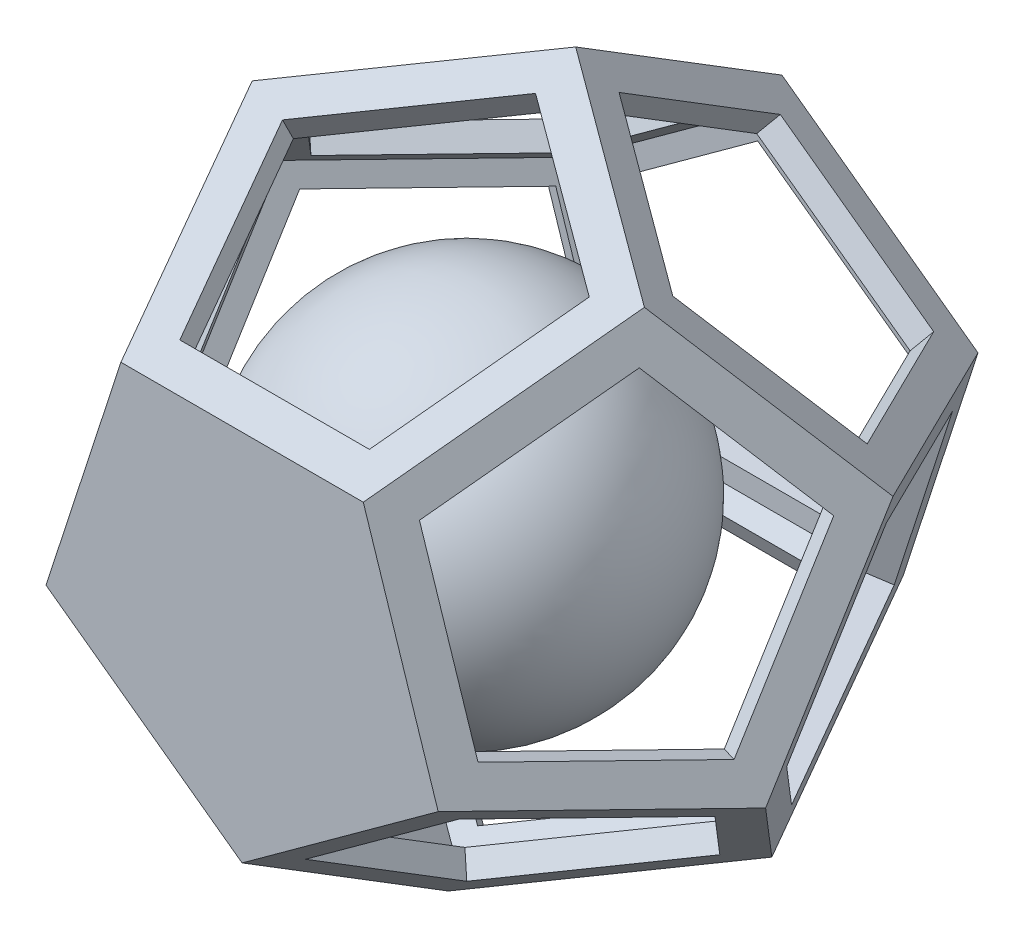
from build123d import *

# Parameters (mm, degrees)
BOSS_EXTRUDE2_DEPTH     = 44.54
BOSS_EXTRUDE2_TAPER     = -26.57
CUT_EXTRUDE_THIN1_DEPTH = 50
CUT_EXTRUDE_THIN1_TAPER = 26.57
SHELL1_T                = 2
CUT_EXTRUDE1_DEPTH      = 12
CIRPATTERN1_COUNT       = 5
CUT_EXTRUDE2_DEPTH      = 12
CIRPATTERN2_COUNT       = 5
CUT_EXTRUDE3_DEPTH      = 8


with BuildPart() as part:
    # Sketch1 → Boss-Extrude2 (new body)
    with BuildSketch(Plane.XY):
        Polygon((0, 17.013016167), (-16.180339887, 5.257311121), (-10, -13.763819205), (10, -13.763819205), (16.180339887, 5.257311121), align=None)
    extrude(amount=BOSS_EXTRUDE2_DEPTH, taper=BOSS_EXTRUDE2_TAPER)

    # Sketch3 → Cut-Extrude-Thin1 (cut)
    with BuildSketch(Plane.XY.offset(44.54)):
        Polygon((-35.42898848, 48.763819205), (-57.325307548, -18.626121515), (0, -60.27539538), (57.325307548, -18.626121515), (35.42898848, 48.763819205), align=None)
        Polygon((-10, 13.763819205), (-16.180339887, -5.257311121), (0, -17.013016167), (16.180339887, -5.257311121), (10, 13.763819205), align=None, mode=Mode.SUBTRACT)
    extrude(amount=-CUT_EXTRUDE_THIN1_DEPTH, taper=CUT_EXTRUDE_THIN1_TAPER, mode=Mode.SUBTRACT)

    # Shell1 (no face opened: a closed hollow body)
    add(offset(amount=-SHELL1_T, mode=Mode.PRIVATE), mode=Mode.SUBTRACT)

    # Sketch5 → Cut-Extrude1 (cut)
    with BuildSketch(Plane(origin=(0, 28.828412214, 14.417318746), x_dir=(1, 0, 0), z_dir=(-1.0084859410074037e-15, 0.894388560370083, 0.44729084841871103))):
        Polygon((12.654932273, -15.80331868), (0, -6.610560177), (-12.654932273, -15.80331868), (-7.820488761, -30.679636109), (7.820488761, -30.679636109), align=None)
    cut_extrude1 = extrude(amount=-CUT_EXTRUDE1_DEPTH, mode=Mode.SUBTRACT)

    # CirPattern1: Cut-Extrude1 ×5 about axis
    cirpattern1_axis = Axis((0, 0, 0), (0, 0, 1))
    for i in range(1, CIRPATTERN1_COUNT):
        add(cut_extrude1.rotate(cirpattern1_axis, i * 360 / CIRPATTERN1_COUNT), mode=Mode.SUBTRACT)

    # Sketch6 → Cut-Extrude2 (cut)
    with BuildSketch(Plane(origin=(-6.471576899, 8.907361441, -5.506240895), x_dir=(0.8506648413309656, 0.44716758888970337, -0.2764244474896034), z_dir=(-0.5257084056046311, 0.7235755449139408, -0.4472908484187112))):
        Polygon((-10.268850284, -31.598812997), (4.607669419, -26.767324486), (4.607669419, -11.125180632), (-10.267538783, -6.291097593), (-19.463045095, -18.944924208), align=None)
    cut_extrude2 = extrude(amount=-CUT_EXTRUDE2_DEPTH, mode=Mode.SUBTRACT)

    # CirPattern2: Cut-Extrude2 ×5 about axis
    cirpattern2_axis = Axis((0, 0, 0), (0, 0, 1))
    for i in range(1, CIRPATTERN2_COUNT):
        add(cut_extrude2.rotate(cirpattern2_axis, i * 360 / CIRPATTERN2_COUNT), mode=Mode.SUBTRACT)

    # Sketch9 → Cut-Extrude3 (cut)
    with BuildSketch(Plane(origin=(0, 0, 0), x_dir=(-1, 0, 0), z_dir=(0, 0, -1))):
        Polygon((0, 13.304812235), (-12.653628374, 4.111413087), (-7.820372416, -10.763819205), (7.820372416, -10.763819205), (12.653628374, 4.111413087), align=None)
    extrude(amount=-CUT_EXTRUDE3_DEPTH, mode=Mode.SUBTRACT)


with BuildPart() as body_2:
    # Sketch8 → Revolve1 (revolve)
    with BuildSketch(Plane(origin=(0, 0, 0), x_dir=(1, 0, 0), z_dir=(0, 1, 0))):
        with BuildLine():
            Line((0, -41.012322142), (0, -11.012322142))
            ThreePointArc((0, -11.012322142), (-15, -26.012322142), (0, -41.012322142))
        make_face()
    revolve(axis=Axis((0, 0, -2.227), (0, 0, 1)))


solid = Compound([part.part, body_2.part])
